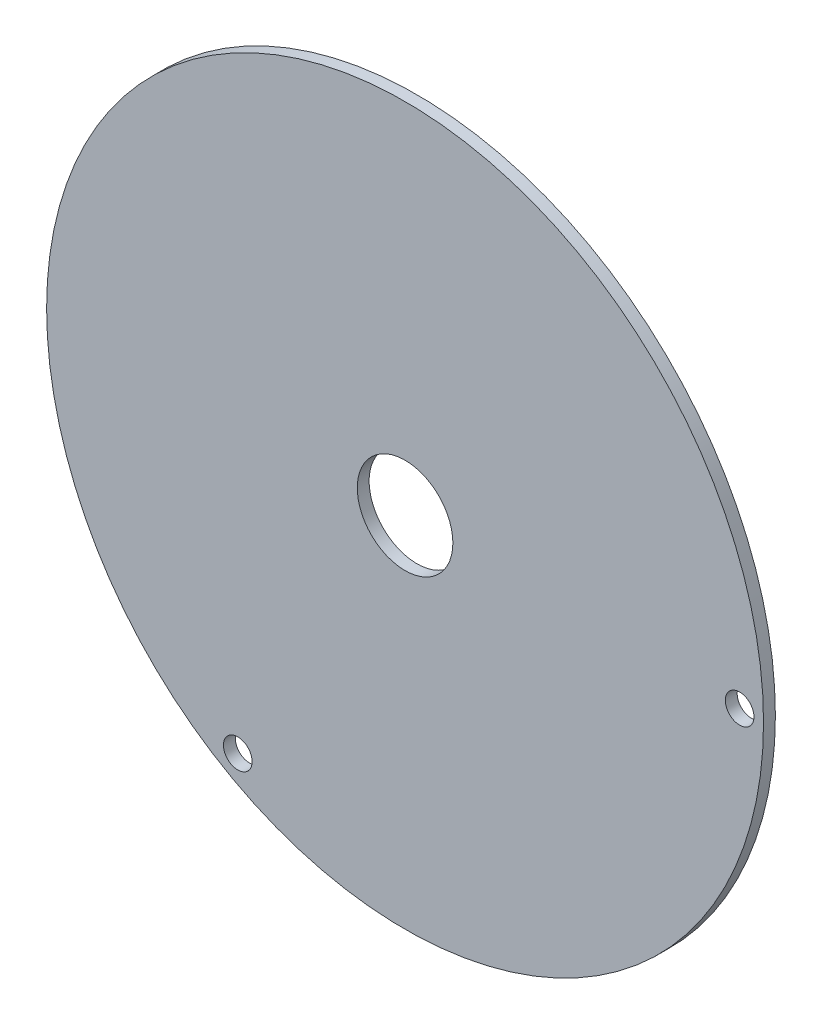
from build123d import *

# Parameters (mm, degrees)
SKETCH1_R          = 47.625
BASE_EXTRUDE_DEPTH = 1.5748
SKETCH2_R          = 1.905
SKETCH2_R_2        = 6.35
CUT_EXTRUDE1_DEPTH = 68.370329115


with BuildPart() as part:
    # Sketch1 → Base-Extrude (new body)
    with BuildSketch(Plane.XY):
        Circle(SKETCH1_R)
    extrude(amount=BASE_EXTRUDE_DEPTH)

    # Sketch2 → Cut-Extrude1 (cut, through all)
    with BuildSketch(Plane.XY.offset(1.5748)):
        with Locations((44.45, 0)):
            Circle(SKETCH2_R)
        with Locations((-22.225, -38.494829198)):
            Circle(SKETCH2_R)
        Circle(SKETCH2_R_2)
    extrude(amount=-CUT_EXTRUDE1_DEPTH, mode=Mode.SUBTRACT)


solid = part.part
